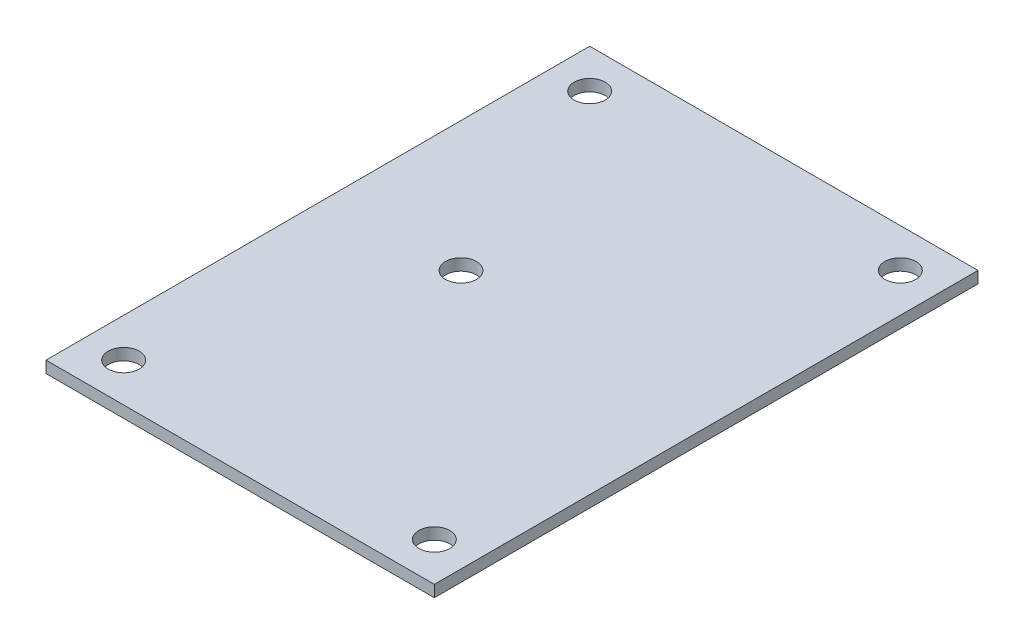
from build123d import *

# Parameters (mm, degrees)
SKETCH1_W      = 50
SKETCH1_H      = 70
SKETCH1_R      = 2
EXTRUDE1_DEPTH = 1.5
SKETCH2_R      = 2
EXTRUDE2_DEPTH = 10


with BuildPart() as part:
    # Sketch1 → Extrude1 (new body)
    with BuildSketch(Plane(origin=(0, 0, 0), x_dir=(1, 0, 0), z_dir=(0, 1, 0))):
        Rectangle(SKETCH1_W, SKETCH1_H)
        with Locations(Location((20, 30, 0), (0, 0, 270))):
            Circle(SKETCH1_R, mode=Mode.SUBTRACT)
        with Locations(Location((-20, 30, 0), (0, 0, 90))):
            Circle(SKETCH1_R, mode=Mode.SUBTRACT)
        with Locations(Location((-20, -30, 0), (0, 0, 270))):
            Circle(SKETCH1_R, mode=Mode.SUBTRACT)
        with Locations(Location((20, -30, 0), (0, 0, 90))):
            Circle(SKETCH1_R, mode=Mode.SUBTRACT)
    extrude(amount=EXTRUDE1_DEPTH)

    # Sketch2 → Extrude2 (cut)
    with BuildSketch(Plane(origin=(0, 1.5, 0), x_dir=(1, 0, 0), z_dir=(0, 1, 0))):
        with Locations(Location((-8.284271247, 1.715728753, 0), (0, 0, 270))):
            Circle(SKETCH2_R)
    extrude(amount=-EXTRUDE2_DEPTH, mode=Mode.SUBTRACT)


solid = part.part
